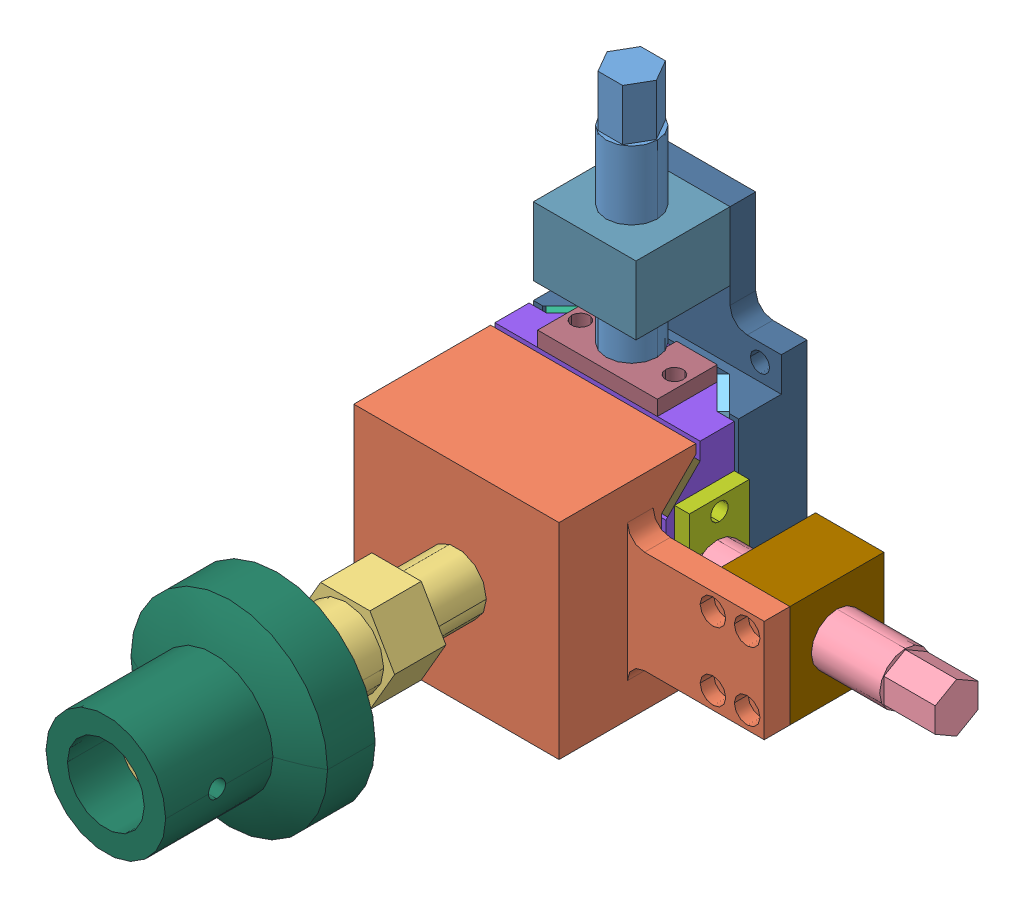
SolidWorks assembly Dewar Alignment Support, Front, OSIRIS.SLDASM, configuration Default (file format 5000). Lengths in mm.
Overall size (174.16 184.15 222.25).
15 component instances, 15 part files, 0 mates.
Components (placement in the parent):
- _U329-1: _U329.sldprt [Default] at (0.0013 147.9695 447.2261) size (19.05 95.25 19.05)
- _U458-1: _U458.sldprt [Default] at (25.4013 62.2445 486.9136) size (127 76.2 50.8)
- _U459-1: _U459.sldprt [Default] at (0.0013 62.2445 547.2386) size (36.66 31.75 152.4)
- _U472-1: _U472.sldprt [Default] at (85.7263 62.2445 459.9261) size (95.25 19.05 19.05)
- _U473-1: _U473.sldprt [Default] at (26.8526 62.2445 440.0824) size (14.29 76.2 14.29)
- _U474-1: _U474.sldprt [Default] at (-26.8501 62.2445 440.0824) size (14.29 76.2 14.29)
- _U475-1: _U475.sldprt [Default] at (40.8794 62.2445 458.3386) size (5.56 44.45 22.23)
- _U476-1: _U476.sldprt [Default] at (0.0013 62.2445 453.5761) size (76.2 76.2 38.1)
- _U477-1: _U477.sldprt [Default] at (76.2013 62.2445 459.9261) size (25.4 38.1 34.92)
- _U478-1: _U478.sldprt [Default] at (0.0013 81.2945 432.9386) size (76.2 139.7 25.4)
- _U479-1: _U479.sldprt [Default] at (0.0013 35.3932 467.0699) size (76.2 14.29 14.29)
- _U480-1: _U480.sldprt [Default] at (0.0013 89.0958 467.0699) size (76.2 14.29 14.29)
- _U481-1: _U481.sldprt [Default] at (0.0013 103.1226 448.8136) size (44.45 5.56 22.23)
- _U482-1: _U482.sldprt [Default] at (0.0013 138.4445 447.2261) size (38.1 25.4 34.92)
- _U485-1: _U485.sldprt [Default] at (0.0013 62.2445 610.7386) size (85.78 86.52 64.68)
